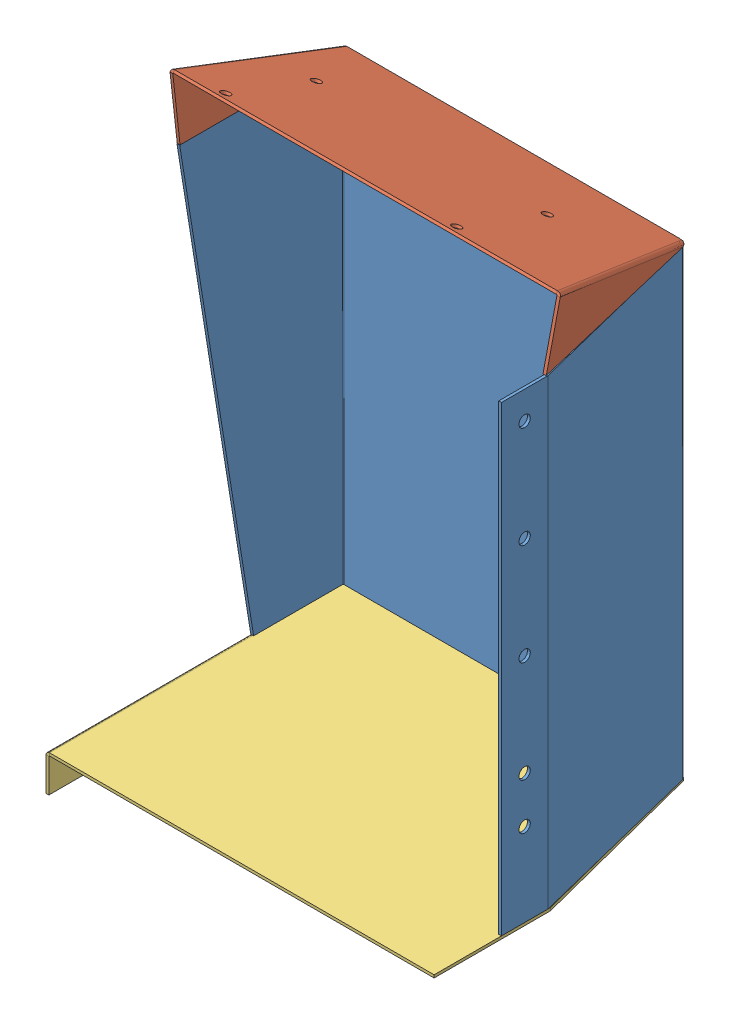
SolidWorks assembly ZLJX-XS-03-04.SLDASM, configuration 默认 (file format 17000). Lengths in mm.
Overall size (423.48 614.65 320.66).
3 component instances, 3 part files, 5 mates.
Components (placement in the parent):
- ZLJX-XS-03-04-1-1: ZLJX-XS-03-04-1.SLDPRT [默认] at (-238.7765 267.9775 0) size (418.38 500 247.06)
- ZLJX-XS-03-04-2-1: ZLJX-XS-03-04-2.SLDPRT [默认] at (-238.7765 342.3498 186.4608) x (1 0 0) z (0 -0.933777 0.357855) size (421.86 200.32 73.28)
- ZLJX-XS-03-04-3-1: ZLJX-XS-03-04-3.SLDPRT [默认] at (-240.3921 -235.0225 0) x (1 0 0) z (0 1 0) size (420 320 40)
Mates (geometry in assembly coordinates):
- 重合1: coincident anti-aligned: plane of ZLJX-XS-03-04-1-1 through (-241.7765 267.9775 3) normal (0 1 0); plane of ZLJX-XS-03-04-2-1 through (-241.7765 267.9775 179.6225) normal (0 -1 0)
- 重合2: coincident aligned: plane of ZLJX-XS-03-04-1-1 through (-241.7765 267.9775 3) normal (-1 0 0); plane of ZLJX-XS-03-04-2-1 through (-241.7765 267.9775 179.6225) normal (-1 0 0)
- 重合6: coincident anti-aligned: plane of ZLJX-XS-03-04-1-1 through (-241.7765 -232.0225 100) normal (0 -1 0); plane of ZLJX-XS-03-04-3-1 through (-240.3921 -232.0225 0) normal (0 1 0)
- 重合7: coincident aligned: plane of ZLJX-XS-03-04-1-1 through (-238.7765 -232.0225 0) normal (0 0 -1); plane of ZLJX-XS-03-04-3-1 through (-240.3921 -232.0225 0) normal (0 0 -1)
- 重合8: coincident aligned: plane of ZLJX-XS-03-04-1-1 through (176.6079 267.9775 197.0591) normal (1 0 0); plane of ZLJX-XS-03-04-3-1 through (176.6079 -232.0225 194) normal (1 0 0)
